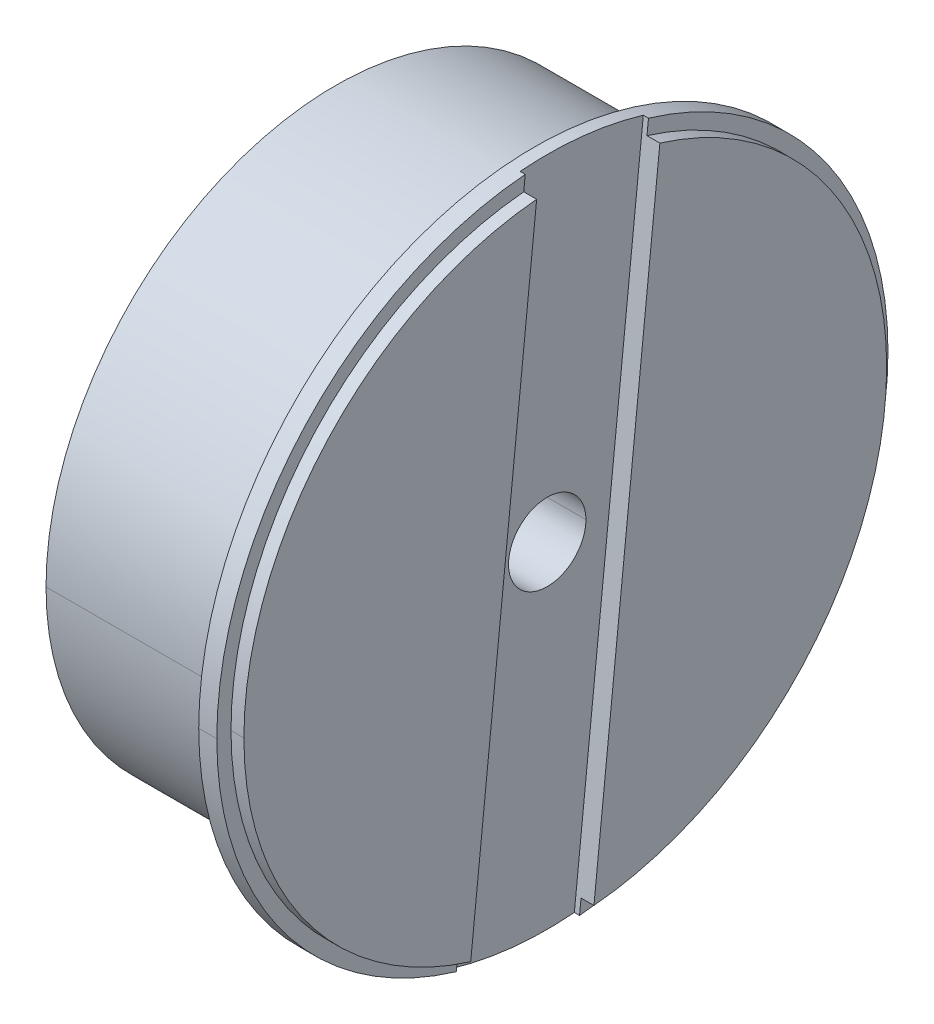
ISO-10303-21;
HEADER;
FILE_DESCRIPTION(('STEP AP214'),'2;1');
FILE_NAME('part.step','',(''),(''),'','','');
FILE_SCHEMA(('AUTOMOTIVE_DESIGN { 1 0 10303 214 1 1 1 1 }'));
ENDSEC;
DATA;
#1=APPLICATION_CONTEXT('core data for automotive mechanical design processes');
#2=APPLICATION_PROTOCOL_DEFINITION('international standard','automotive_design',2000,#1);
#3=PRODUCT_CONTEXT('',#1,'mechanical');
#4=PRODUCT('Part','Part','',(#3));
#5=PRODUCT_RELATED_PRODUCT_CATEGORY('part','',(#4));
#6=PRODUCT_DEFINITION_FORMATION('','',#4);
#7=PRODUCT_DEFINITION_CONTEXT('part definition',#1,'design');
#8=PRODUCT_DEFINITION('design','',#6,#7);
#9=PRODUCT_DEFINITION_SHAPE('','',#8);
#10=(LENGTH_UNIT() NAMED_UNIT(*) SI_UNIT(.MILLI.,.METRE.));
#11=(NAMED_UNIT(*) PLANE_ANGLE_UNIT() SI_UNIT($,.RADIAN.));
#12=(NAMED_UNIT(*) SI_UNIT($,.STERADIAN.) SOLID_ANGLE_UNIT());
#13=UNCERTAINTY_MEASURE_WITH_UNIT(LENGTH_MEASURE(1.E-05),#10,'distance_accuracy_value','');
#14=(GEOMETRIC_REPRESENTATION_CONTEXT(3) GLOBAL_UNCERTAINTY_ASSIGNED_CONTEXT((#13)) GLOBAL_UNIT_ASSIGNED_CONTEXT((#10,
#11,#12)) REPRESENTATION_CONTEXT('',''));
#15=CARTESIAN_POINT('',(0.,0.,0.));
#16=DIRECTION('',(0.,0.,1.));
#17=DIRECTION('',(1.,0.,0.));
#18=AXIS2_PLACEMENT_3D('',#15,#16,#17);
#19=CARTESIAN_POINT('',(68.8,0.,0.));
#20=DIRECTION('',(-1.,0.,0.));
#21=DIRECTION('',(0.,0.,-1.));
#22=AXIS2_PLACEMENT_3D('',#19,#20,#21);
#23=CYLINDRICAL_SURFACE('',#22,11.215);
#24=DIRECTION('',(-1.,0.,0.));
#25=VECTOR('',#24,1.);
#26=CARTESIAN_POINT('',(68.8,0.,-11.215));
#27=LINE('',#26,#25);
#28=CARTESIAN_POINT('',(72.3,0.,-11.215));
#29=VERTEX_POINT('',#28);
#30=CARTESIAN_POINT('',(64.6,0.,-11.215));
#31=VERTEX_POINT('',#30);
#32=EDGE_CURVE('E191',#29,#31,#27,.T.);
#33=ORIENTED_EDGE('',*,*,#32,.F.);
#34=CARTESIAN_POINT('',(72.3,0.,0.));
#35=DIRECTION('',(1.,0.,0.));
#36=DIRECTION('',(0.,0.,-1.));
#37=AXIS2_PLACEMENT_3D('',#34,#35,#36);
#38=CIRCLE('',#37,11.215);
#39=CARTESIAN_POINT('',(72.3,0.,11.215));
#40=VERTEX_POINT('',#39);
#41=EDGE_CURVE('E40',#40,#29,#38,.T.);
#42=ORIENTED_EDGE('',*,*,#41,.F.);
#43=DIRECTION('',(1.,0.,0.));
#44=VECTOR('',#43,1.);
#45=CARTESIAN_POINT('',(68.8,0.,11.215));
#46=LINE('',#45,#44);
#47=CARTESIAN_POINT('',(64.6,0.,11.215));
#48=VERTEX_POINT('',#47);
#49=EDGE_CURVE('E188',#48,#40,#46,.T.);
#50=ORIENTED_EDGE('',*,*,#49,.F.);
#51=CARTESIAN_POINT('',(64.6,0.,0.));
#52=DIRECTION('',(-1.,0.,0.));
#53=DIRECTION('',(0.,0.,-1.));
#54=AXIS2_PLACEMENT_3D('',#51,#52,#53);
#55=CIRCLE('',#54,11.215);
#56=EDGE_CURVE('E192',#31,#48,#55,.T.);
#57=ORIENTED_EDGE('',*,*,#56,.F.);
#58=EDGE_LOOP('',(#33,#42,#50,#57));
#59=FACE_BOUND('',#58,.T.);
#60=ADVANCED_FACE('F16',(#59),#23,.T.);
#61=CARTESIAN_POINT('',(73.25,0.,0.));
#62=DIRECTION('',(1.,0.,0.));
#63=DIRECTION('',(0.,0.,-1.));
#64=AXIS2_PLACEMENT_3D('',#61,#62,#63);
#65=CYLINDRICAL_SURFACE('',#64,12.45);
#66=DIRECTION('',(1.,0.,0.));
#67=VECTOR('',#66,1.);
#68=CARTESIAN_POINT('',(73.25,0.,-12.45));
#69=LINE('',#68,#67);
#70=CARTESIAN_POINT('',(73.,0.,-12.45));
#71=VERTEX_POINT('',#70);
#72=CARTESIAN_POINT('',(73.5,0.,-12.45));
#73=VERTEX_POINT('',#72);
#74=EDGE_CURVE('E247',#71,#73,#69,.T.);
#75=ORIENTED_EDGE('',*,*,#74,.F.);
#76=CARTESIAN_POINT('',(73.,0.,0.));
#77=DIRECTION('',(-1.,0.,0.));
#78=DIRECTION('',(0.,0.,-1.));
#79=AXIS2_PLACEMENT_3D('',#76,#77,#78);
#80=CIRCLE('',#79,12.45);
#81=CARTESIAN_POINT('',(73.,11.8986932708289,-3.66382292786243));
#82=VERTEX_POINT('',#81);
#83=EDGE_CURVE('E187',#82,#71,#80,.T.);
#84=ORIENTED_EDGE('',*,*,#83,.F.);
#85=DIRECTION('',(1.,0.,0.));
#86=VECTOR('',#85,1.);
#87=CARTESIAN_POINT('',(73.25,11.8986932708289,-3.66382292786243));
#88=LINE('',#87,#86);
#89=CARTESIAN_POINT('',(73.5,11.8986932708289,-3.66382292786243));
#90=VERTEX_POINT('',#89);
#91=EDGE_CURVE('E11',#82,#90,#88,.T.);
#92=ORIENTED_EDGE('',*,*,#91,.T.);
#93=CARTESIAN_POINT('',(73.5,0.,0.));
#94=DIRECTION('',(1.,0.,0.));
#95=DIRECTION('',(0.,0.,-1.));
#96=AXIS2_PLACEMENT_3D('',#93,#94,#95);
#97=CIRCLE('',#96,12.45);
#98=EDGE_CURVE('E240',#73,#90,#97,.T.);
#99=ORIENTED_EDGE('',*,*,#98,.F.);
#100=EDGE_LOOP('',(#75,#84,#92,#99));
#101=FACE_BOUND('',#100,.T.);
#102=ADVANCED_FACE('F564',(#101),#65,.T.);
#103=CARTESIAN_POINT('',(72.65,0.,0.));
#104=DIRECTION('',(-1.,0.,0.));
#105=DIRECTION('',(0.,0.,-1.));
#106=AXIS2_PLACEMENT_3D('',#103,#104,#105);
#107=CYLINDRICAL_SURFACE('',#106,13.);
#108=DIRECTION('',(-1.,0.,0.));
#109=VECTOR('',#108,1.);
#110=CARTESIAN_POINT('',(72.65,0.,-13.));
#111=LINE('',#110,#109);
#112=CARTESIAN_POINT('',(73.,0.,-13.));
#113=VERTEX_POINT('',#112);
#114=CARTESIAN_POINT('',(72.3,0.,-13.));
#115=VERTEX_POINT('',#114);
#116=EDGE_CURVE('E150',#113,#115,#111,.T.);
#117=ORIENTED_EDGE('',*,*,#116,.F.);
#118=CARTESIAN_POINT('',(73.,0.,0.));
#119=DIRECTION('',(1.,0.,0.));
#120=DIRECTION('',(0.,0.,-1.));
#121=AXIS2_PLACEMENT_3D('',#118,#119,#120);
#122=CIRCLE('',#121,13.);
#123=CARTESIAN_POINT('',(73.,-12.9574180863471,-1.05134035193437));
#124=VERTEX_POINT('',#123);
#125=EDGE_CURVE('E144',#124,#113,#122,.T.);
#126=ORIENTED_EDGE('',*,*,#125,.F.);
#127=DIRECTION('',(-1.,0.,0.));
#128=VECTOR('',#127,1.);
#129=CARTESIAN_POINT('',(72.9,-12.9574180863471,-1.05134035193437));
#130=LINE('',#129,#128);
#131=CARTESIAN_POINT('',(72.8,-12.9574180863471,-1.05134035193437));
#132=VERTEX_POINT('',#131);
#133=EDGE_CURVE('E27',#124,#132,#130,.T.);
#134=ORIENTED_EDGE('',*,*,#133,.T.);
#135=CARTESIAN_POINT('',(72.8,0.,0.));
#136=DIRECTION('',(-1.,0.,0.));
#137=DIRECTION('',(0.,0.,-1.));
#138=AXIS2_PLACEMENT_3D('',#135,#136,#137);
#139=CIRCLE('',#138,13.);
#140=CARTESIAN_POINT('',(72.8,-12.4556814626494,3.72236474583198));
#141=VERTEX_POINT('',#140);
#142=EDGE_CURVE('E166',#132,#141,#139,.T.);
#143=ORIENTED_EDGE('',*,*,#142,.T.);
#144=DIRECTION('',(1.,0.,0.));
#145=VECTOR('',#144,1.);
#146=CARTESIAN_POINT('',(72.9,-12.4556814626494,3.72236474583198));
#147=LINE('',#146,#145);
#148=CARTESIAN_POINT('',(73.,-12.4556814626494,3.72236474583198));
#149=VERTEX_POINT('',#148);
#150=EDGE_CURVE('E288',#141,#149,#147,.T.);
#151=ORIENTED_EDGE('',*,*,#150,.T.);
#152=CARTESIAN_POINT('',(73.,0.,0.));
#153=DIRECTION('',(1.,0.,0.));
#154=DIRECTION('',(0.,0.,-1.));
#155=AXIS2_PLACEMENT_3D('',#152,#153,#154);
#156=CIRCLE('',#155,13.);
#157=CARTESIAN_POINT('',(73.,0.,13.));
#158=VERTEX_POINT('',#157);
#159=EDGE_CURVE('E174',#158,#149,#156,.T.);
#160=ORIENTED_EDGE('',*,*,#159,.F.);
#161=DIRECTION('',(1.,0.,0.));
#162=VECTOR('',#161,1.);
#163=CARTESIAN_POINT('',(72.65,0.,13.));
#164=LINE('',#163,#162);
#165=CARTESIAN_POINT('',(72.3,0.,13.));
#166=VERTEX_POINT('',#165);
#167=EDGE_CURVE('E217',#166,#158,#164,.T.);
#168=ORIENTED_EDGE('',*,*,#167,.F.);
#169=CARTESIAN_POINT('',(72.3,0.,0.));
#170=DIRECTION('',(-1.,0.,0.));
#171=DIRECTION('',(0.,0.,-1.));
#172=AXIS2_PLACEMENT_3D('',#169,#170,#171);
#173=CIRCLE('',#172,13.);
#174=EDGE_CURVE('E261',#115,#166,#173,.T.);
#175=ORIENTED_EDGE('',*,*,#174,.F.);
#176=EDGE_LOOP('',(#117,#126,#134,#143,#151,#160,#168,#175));
#177=FACE_BOUND('',#176,.T.);
#178=ADVANCED_FACE('F146',(#177),#107,.T.);
#179=CARTESIAN_POINT('',(73.25,0.,0.));
#180=DIRECTION('',(1.,0.,0.));
#181=DIRECTION('',(0.,0.,-1.));
#182=AXIS2_PLACEMENT_3D('',#179,#180,#181);
#183=CYLINDRICAL_SURFACE('',#182,12.45);
#184=DIRECTION('',(-1.,0.,0.));
#185=VECTOR('',#184,1.);
#186=CARTESIAN_POINT('',(73.25,0.,12.45));
#187=LINE('',#186,#185);
#188=CARTESIAN_POINT('',(73.5,0.,12.45));
#189=VERTEX_POINT('',#188);
#190=CARTESIAN_POINT('',(73.,0.,12.45));
#191=VERTEX_POINT('',#190);
#192=EDGE_CURVE('E225',#189,#191,#187,.T.);
#193=ORIENTED_EDGE('',*,*,#192,.F.);
#194=CARTESIAN_POINT('',(73.5,0.,0.));
#195=DIRECTION('',(1.,0.,0.));
#196=DIRECTION('',(0.,0.,-1.));
#197=AXIS2_PLACEMENT_3D('',#194,#195,#196);
#198=CIRCLE('',#197,12.45);
#199=CARTESIAN_POINT('',(73.5,12.4004298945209,1.10988216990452));
#200=VERTEX_POINT('',#199);
#201=EDGE_CURVE('E278',#200,#189,#198,.T.);
#202=ORIENTED_EDGE('',*,*,#201,.F.);
#203=DIRECTION('',(-1.,0.,0.));
#204=VECTOR('',#203,1.);
#205=CARTESIAN_POINT('',(73.25,12.4004298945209,1.10988216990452));
#206=LINE('',#205,#204);
#207=CARTESIAN_POINT('',(73.,12.4004298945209,1.10988216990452));
#208=VERTEX_POINT('',#207);
#209=EDGE_CURVE('E284',#200,#208,#206,.T.);
#210=ORIENTED_EDGE('',*,*,#209,.T.);
#211=CARTESIAN_POINT('',(73.,0.,0.));
#212=DIRECTION('',(-1.,0.,0.));
#213=DIRECTION('',(0.,0.,-1.));
#214=AXIS2_PLACEMENT_3D('',#211,#212,#213);
#215=CIRCLE('',#214,12.45);
#216=EDGE_CURVE('E235',#191,#208,#215,.T.);
#217=ORIENTED_EDGE('',*,*,#216,.F.);
#218=EDGE_LOOP('',(#193,#202,#210,#217));
#219=FACE_BOUND('',#218,.T.);
#220=ADVANCED_FACE('F563',(#219),#183,.T.);
#221=CARTESIAN_POINT('',(65.,0.,0.));
#222=DIRECTION('',(-1.,0.,0.));
#223=DIRECTION('',(0.,0.,-1.));
#224=AXIS2_PLACEMENT_3D('',#221,#222,#223);
#225=CYLINDRICAL_SURFACE('',#224,1.5);
#226=DIRECTION('',(1.,0.,0.));
#227=VECTOR('',#226,1.);
#228=CARTESIAN_POINT('',(65.,0.,-1.5));
#229=LINE('',#228,#227);
#230=CARTESIAN_POINT('',(64.6,0.,-1.5));
#231=VERTEX_POINT('',#230);
#232=CARTESIAN_POINT('',(72.8,0.,-1.5));
#233=VERTEX_POINT('',#232);
#234=EDGE_CURVE('E255',#231,#233,#229,.T.);
#235=ORIENTED_EDGE('',*,*,#234,.F.);
#236=CARTESIAN_POINT('',(64.6,0.,0.));
#237=DIRECTION('',(1.,0.,0.));
#238=DIRECTION('',(0.,0.,-1.));
#239=AXIS2_PLACEMENT_3D('',#236,#237,#238);
#240=CIRCLE('',#239,1.5);
#241=CARTESIAN_POINT('',(64.6,0.,1.5));
#242=VERTEX_POINT('',#241);
#243=EDGE_CURVE('E211',#242,#231,#240,.T.);
#244=ORIENTED_EDGE('',*,*,#243,.F.);
#245=DIRECTION('',(-1.,0.,0.));
#246=VECTOR('',#245,1.);
#247=CARTESIAN_POINT('',(65.,0.,1.5));
#248=LINE('',#247,#246);
#249=CARTESIAN_POINT('',(72.8,0.,1.5));
#250=VERTEX_POINT('',#249);
#251=EDGE_CURVE('E251',#250,#242,#248,.T.);
#252=ORIENTED_EDGE('',*,*,#251,.F.);
#253=CARTESIAN_POINT('',(72.8,0.,0.));
#254=DIRECTION('',(-1.,0.,0.));
#255=DIRECTION('',(0.,0.,-1.));
#256=AXIS2_PLACEMENT_3D('',#253,#254,#255);
#257=CIRCLE('',#256,1.5);
#258=EDGE_CURVE('E274',#233,#250,#257,.T.);
#259=ORIENTED_EDGE('',*,*,#258,.F.);
#260=EDGE_LOOP('',(#235,#244,#252,#259));
#261=FACE_BOUND('',#260,.T.);
#262=ADVANCED_FACE('F590',(#261),#225,.F.);
#263=CARTESIAN_POINT('',(65.,0.,0.));
#264=DIRECTION('',(-1.,0.,0.));
#265=DIRECTION('',(0.,0.,-1.));
#266=AXIS2_PLACEMENT_3D('',#263,#264,#265);
#267=CYLINDRICAL_SURFACE('',#266,1.5);
#268=ORIENTED_EDGE('',*,*,#234,.T.);
#269=CARTESIAN_POINT('',(72.8,0.,0.));
#270=DIRECTION('',(-1.,0.,0.));
#271=DIRECTION('',(0.,0.,-1.));
#272=AXIS2_PLACEMENT_3D('',#269,#270,#271);
#273=CIRCLE('',#272,1.5);
#274=EDGE_CURVE('E311',#250,#233,#273,.T.);
#275=ORIENTED_EDGE('',*,*,#274,.F.);
#276=ORIENTED_EDGE('',*,*,#251,.T.);
#277=CARTESIAN_POINT('',(64.6,0.,0.));
#278=DIRECTION('',(1.,0.,0.));
#279=DIRECTION('',(0.,0.,-1.));
#280=AXIS2_PLACEMENT_3D('',#277,#278,#279);
#281=CIRCLE('',#280,1.5);
#282=EDGE_CURVE('E281',#231,#242,#281,.T.);
#283=ORIENTED_EDGE('',*,*,#282,.F.);
#284=EDGE_LOOP('',(#268,#275,#276,#283));
#285=FACE_BOUND('',#284,.T.);
#286=ADVANCED_FACE('F581',(#285),#267,.F.);
#287=CARTESIAN_POINT('',(73.5,0.,0.));
#288=DIRECTION('',(1.,0.,0.));
#289=DIRECTION('',(0.,1.,0.));
#290=AXIS2_PLACEMENT_3D('',#287,#288,#289);
#291=PLANE('',#290);
#292=DIRECTION('',(0.,0.994521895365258,-0.104528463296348));
#293=VECTOR('',#292,1.);
#294=CARTESIAN_POINT('',(73.5,-2.98132784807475,2.72657005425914));
#295=LINE('',#294,#293);
#296=CARTESIAN_POINT('',(73.5,-11.8986932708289,3.66382292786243));
#297=VERTEX_POINT('',#296);
#298=EDGE_CURVE('E256',#297,#200,#295,.T.);
#299=ORIENTED_EDGE('',*,*,#298,.T.);
#300=ORIENTED_EDGE('',*,*,#201,.T.);
#301=CARTESIAN_POINT('',(73.5,0.,0.));
#302=DIRECTION('',(1.,0.,0.));
#303=DIRECTION('',(0.,0.,-1.));
#304=AXIS2_PLACEMENT_3D('',#301,#302,#303);
#305=CIRCLE('',#304,12.45);
#306=EDGE_CURVE('E275',#189,#297,#305,.T.);
#307=ORIENTED_EDGE('',*,*,#306,.T.);
#308=EDGE_LOOP('',(#299,#300,#307));
#309=FACE_BOUND('',#308,.T.);
#310=ADVANCED_FACE('F337',(#309),#291,.T.);
#311=CARTESIAN_POINT('',(73.5,0.,0.));
#312=DIRECTION('',(1.,0.,0.));
#313=DIRECTION('',(0.,1.,0.));
#314=AXIS2_PLACEMENT_3D('',#311,#312,#313);
#315=PLANE('',#314);
#316=DIRECTION('',(0.,-0.994521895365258,0.104528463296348));
#317=VECTOR('',#316,1.);
#318=CARTESIAN_POINT('',(73.5,-3.48306447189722,-2.0471350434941));
#319=LINE('',#318,#317);
#320=CARTESIAN_POINT('',(73.5,-12.4004298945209,-1.10988216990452));
#321=VERTEX_POINT('',#320);
#322=EDGE_CURVE('E214',#90,#321,#319,.T.);
#323=ORIENTED_EDGE('',*,*,#322,.T.);
#324=CARTESIAN_POINT('',(73.5,0.,0.));
#325=DIRECTION('',(1.,0.,0.));
#326=DIRECTION('',(0.,0.,-1.));
#327=AXIS2_PLACEMENT_3D('',#324,#325,#326);
#328=CIRCLE('',#327,12.45);
#329=EDGE_CURVE('E236',#321,#73,#328,.T.);
#330=ORIENTED_EDGE('',*,*,#329,.T.);
#331=ORIENTED_EDGE('',*,*,#98,.T.);
#332=EDGE_LOOP('',(#323,#330,#331));
#333=FACE_BOUND('',#332,.T.);
#334=ADVANCED_FACE('F383',(#333),#315,.T.);
#335=CARTESIAN_POINT('',(73.25,0.,0.));
#336=DIRECTION('',(1.,0.,0.));
#337=DIRECTION('',(0.,0.,-1.));
#338=AXIS2_PLACEMENT_3D('',#335,#336,#337);
#339=CYLINDRICAL_SURFACE('',#338,12.45);
#340=ORIENTED_EDGE('',*,*,#192,.T.);
#341=CARTESIAN_POINT('',(73.,0.,0.));
#342=DIRECTION('',(-1.,0.,0.));
#343=DIRECTION('',(0.,0.,-1.));
#344=AXIS2_PLACEMENT_3D('',#341,#342,#343);
#345=CIRCLE('',#344,12.45);
#346=CARTESIAN_POINT('',(73.,-11.8986932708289,3.66382292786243));
#347=VERTEX_POINT('',#346);
#348=EDGE_CURVE('E262',#347,#191,#345,.T.);
#349=ORIENTED_EDGE('',*,*,#348,.F.);
#350=DIRECTION('',(1.,0.,0.));
#351=VECTOR('',#350,1.);
#352=CARTESIAN_POINT('',(73.25,-11.8986932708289,3.66382292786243));
#353=LINE('',#352,#351);
#354=EDGE_CURVE('E222',#347,#297,#353,.T.);
#355=ORIENTED_EDGE('',*,*,#354,.T.);
#356=ORIENTED_EDGE('',*,*,#306,.F.);
#357=EDGE_LOOP('',(#340,#349,#355,#356));
#358=FACE_BOUND('',#357,.T.);
#359=ADVANCED_FACE('F344',(#358),#339,.T.);
#360=CARTESIAN_POINT('',(72.65,0.,0.));
#361=DIRECTION('',(-1.,0.,0.));
#362=DIRECTION('',(0.,0.,-1.));
#363=AXIS2_PLACEMENT_3D('',#360,#361,#362);
#364=CYLINDRICAL_SURFACE('',#363,13.);
#365=ORIENTED_EDGE('',*,*,#116,.T.);
#366=CARTESIAN_POINT('',(72.3,0.,0.));
#367=DIRECTION('',(-1.,0.,0.));
#368=DIRECTION('',(0.,0.,-1.));
#369=AXIS2_PLACEMENT_3D('',#366,#367,#368);
#370=CIRCLE('',#369,13.);
#371=EDGE_CURVE('E257',#166,#115,#370,.T.);
#372=ORIENTED_EDGE('',*,*,#371,.F.);
#373=ORIENTED_EDGE('',*,*,#167,.T.);
#374=CARTESIAN_POINT('',(73.,0.,0.));
#375=DIRECTION('',(1.,0.,0.));
#376=DIRECTION('',(0.,0.,-1.));
#377=AXIS2_PLACEMENT_3D('',#374,#375,#376);
#378=CIRCLE('',#377,13.);
#379=CARTESIAN_POINT('',(73.,12.9574180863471,1.05134035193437));
#380=VERTEX_POINT('',#379);
#381=EDGE_CURVE('E181',#380,#158,#378,.T.);
#382=ORIENTED_EDGE('',*,*,#381,.F.);
#383=DIRECTION('',(-1.,0.,0.));
#384=VECTOR('',#383,1.);
#385=CARTESIAN_POINT('',(72.9,12.9574180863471,1.05134035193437));
#386=LINE('',#385,#384);
#387=CARTESIAN_POINT('',(72.8,12.9574180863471,1.05134035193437));
#388=VERTEX_POINT('',#387);
#389=EDGE_CURVE('E221',#380,#388,#386,.T.);
#390=ORIENTED_EDGE('',*,*,#389,.T.);
#391=CARTESIAN_POINT('',(72.8,0.,0.));
#392=DIRECTION('',(-1.,0.,0.));
#393=DIRECTION('',(0.,0.,-1.));
#394=AXIS2_PLACEMENT_3D('',#391,#392,#393);
#395=CIRCLE('',#394,13.);
#396=CARTESIAN_POINT('',(72.8,12.4556814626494,-3.72236474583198));
#397=VERTEX_POINT('',#396);
#398=EDGE_CURVE('E230',#388,#397,#395,.T.);
#399=ORIENTED_EDGE('',*,*,#398,.T.);
#400=DIRECTION('',(1.,0.,0.));
#401=VECTOR('',#400,1.);
#402=CARTESIAN_POINT('',(72.9,12.4556814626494,-3.72236474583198));
#403=LINE('',#402,#401);
#404=CARTESIAN_POINT('',(73.,12.4556814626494,-3.72236474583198));
#405=VERTEX_POINT('',#404);
#406=EDGE_CURVE('E269',#397,#405,#403,.T.);
#407=ORIENTED_EDGE('',*,*,#406,.T.);
#408=CARTESIAN_POINT('',(73.,0.,0.));
#409=DIRECTION('',(1.,0.,0.));
#410=DIRECTION('',(0.,0.,-1.));
#411=AXIS2_PLACEMENT_3D('',#408,#409,#410);
#412=CIRCLE('',#411,13.);
#413=EDGE_CURVE('E156',#113,#405,#412,.T.);
#414=ORIENTED_EDGE('',*,*,#413,.F.);
#415=EDGE_LOOP('',(#365,#372,#373,#382,#390,#399,#407,#414));
#416=FACE_BOUND('',#415,.T.);
#417=ADVANCED_FACE('F645',(#416),#364,.T.);
#418=CARTESIAN_POINT('',(73.,0.,0.));
#419=DIRECTION('',(1.,0.,0.));
#420=DIRECTION('',(0.,1.,0.));
#421=AXIS2_PLACEMENT_3D('',#418,#419,#420);
#422=PLANE('',#421);
#423=DIRECTION('',(0.,0.994521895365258,-0.104528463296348));
#424=VECTOR('',#423,1.);
#425=CARTESIAN_POINT('',(73.,-2.98132784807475,2.72657005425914));
#426=LINE('',#425,#424);
#427=EDGE_CURVE('E266',#149,#347,#426,.T.);
#428=ORIENTED_EDGE('',*,*,#427,.T.);
#429=ORIENTED_EDGE('',*,*,#348,.T.);
#430=ORIENTED_EDGE('',*,*,#216,.T.);
#431=DIRECTION('',(0.,0.994521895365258,-0.104528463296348));
#432=VECTOR('',#431,1.);
#433=CARTESIAN_POINT('',(73.,3.48306447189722,2.0471350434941));
#434=LINE('',#433,#432);
#435=EDGE_CURVE('E231',#208,#380,#434,.T.);
#436=ORIENTED_EDGE('',*,*,#435,.T.);
#437=ORIENTED_EDGE('',*,*,#381,.T.);
#438=ORIENTED_EDGE('',*,*,#159,.T.);
#439=EDGE_LOOP('',(#428,#429,#430,#436,#437,#438));
#440=FACE_BOUND('',#439,.T.);
#441=ADVANCED_FACE('F18',(#440),#422,.T.);
#442=CARTESIAN_POINT('',(73.,0.,0.));
#443=DIRECTION('',(1.,0.,0.));
#444=DIRECTION('',(0.,1.,0.));
#445=AXIS2_PLACEMENT_3D('',#442,#443,#444);
#446=PLANE('',#445);
#447=DIRECTION('',(0.,-0.994521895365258,0.104528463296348));
#448=VECTOR('',#447,1.);
#449=CARTESIAN_POINT('',(73.,-3.48306447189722,-2.0471350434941));
#450=LINE('',#449,#448);
#451=CARTESIAN_POINT('',(73.,-12.4004298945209,-1.10988216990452));
#452=VERTEX_POINT('',#451);
#453=EDGE_CURVE('E155',#452,#124,#450,.T.);
#454=ORIENTED_EDGE('',*,*,#453,.T.);
#455=ORIENTED_EDGE('',*,*,#125,.T.);
#456=ORIENTED_EDGE('',*,*,#413,.T.);
#457=DIRECTION('',(0.,-0.994521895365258,0.104528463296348));
#458=VECTOR('',#457,1.);
#459=CARTESIAN_POINT('',(73.,2.98132784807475,-2.72657005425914));
#460=LINE('',#459,#458);
#461=EDGE_CURVE('E241',#405,#82,#460,.T.);
#462=ORIENTED_EDGE('',*,*,#461,.T.);
#463=ORIENTED_EDGE('',*,*,#83,.T.);
#464=CARTESIAN_POINT('',(73.,0.,0.));
#465=DIRECTION('',(-1.,0.,0.));
#466=DIRECTION('',(0.,0.,-1.));
#467=AXIS2_PLACEMENT_3D('',#464,#465,#466);
#468=CIRCLE('',#467,12.45);
#469=EDGE_CURVE('E172',#71,#452,#468,.T.);
#470=ORIENTED_EDGE('',*,*,#469,.T.);
#471=EDGE_LOOP('',(#454,#455,#456,#462,#463,#470));
#472=FACE_BOUND('',#471,.T.);
#473=ADVANCED_FACE('F169',(#472),#446,.T.);
#474=CARTESIAN_POINT('',(73.15,6.21352400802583,-3.06628755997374));
#475=DIRECTION('',(0.,0.104528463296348,0.994521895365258));
#476=DIRECTION('',(1.,0.,0.));
#477=AXIS2_PLACEMENT_3D('',#474,#475,#476);
#478=PLANE('',#477);
#479=ORIENTED_EDGE('',*,*,#406,.F.);
#480=DIRECTION('',(0.,-0.994521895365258,0.104528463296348));
#481=VECTOR('',#480,1.);
#482=CARTESIAN_POINT('',(72.8,-6.7152606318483,-1.7074175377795));
#483=LINE('',#482,#481);
#484=EDGE_CURVE('E164',#397,#132,#483,.T.);
#485=ORIENTED_EDGE('',*,*,#484,.T.);
#486=ORIENTED_EDGE('',*,*,#133,.F.);
#487=ORIENTED_EDGE('',*,*,#453,.F.);
#488=DIRECTION('',(-1.,0.,0.));
#489=VECTOR('',#488,1.);
#490=CARTESIAN_POINT('',(73.25,-12.4004298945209,-1.10988216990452));
#491=LINE('',#490,#489);
#492=EDGE_CURVE('E202',#321,#452,#491,.T.);
#493=ORIENTED_EDGE('',*,*,#492,.F.);
#494=ORIENTED_EDGE('',*,*,#322,.F.);
#495=ORIENTED_EDGE('',*,*,#91,.F.);
#496=ORIENTED_EDGE('',*,*,#461,.F.);
#497=EDGE_LOOP('',(#479,#485,#486,#487,#493,#494,#495,#496));
#498=FACE_BOUND('',#497,.T.);
#499=ADVANCED_FACE('F160',(#498),#478,.T.);
#500=CARTESIAN_POINT('',(72.8,6.46439231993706,-0.679435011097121));
#501=DIRECTION('',(1.,0.,0.));
#502=DIRECTION('',(0.,1.,0.));
#503=AXIS2_PLACEMENT_3D('',#500,#501,#502);
#504=PLANE('',#503);
#505=ORIENTED_EDGE('',*,*,#398,.F.);
#506=DIRECTION('',(0.,-0.994521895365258,0.104528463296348));
#507=VECTOR('',#506,1.);
#508=CARTESIAN_POINT('',(72.8,-6.21352400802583,3.06628755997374));
#509=LINE('',#508,#507);
#510=EDGE_CURVE('E20',#388,#141,#509,.T.);
#511=ORIENTED_EDGE('',*,*,#510,.T.);
#512=ORIENTED_EDGE('',*,*,#142,.F.);
#513=ORIENTED_EDGE('',*,*,#484,.F.);
#514=EDGE_LOOP('',(#505,#511,#512,#513));
#515=FACE_BOUND('',#514,.T.);
#516=ORIENTED_EDGE('',*,*,#274,.T.);
#517=ORIENTED_EDGE('',*,*,#258,.T.);
#518=EDGE_LOOP('',(#516,#517));
#519=FACE_BOUND('',#518,.T.);
#520=ADVANCED_FACE('F526',(#515,#519),#504,.T.);
#521=CARTESIAN_POINT('',(73.15,6.7152606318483,1.7074175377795));
#522=DIRECTION('',(0.,-0.104528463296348,-0.994521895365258));
#523=DIRECTION('',(0.,-0.994521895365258,0.104528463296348));
#524=AXIS2_PLACEMENT_3D('',#521,#522,#523);
#525=PLANE('',#524);
#526=ORIENTED_EDGE('',*,*,#389,.F.);
#527=ORIENTED_EDGE('',*,*,#435,.F.);
#528=ORIENTED_EDGE('',*,*,#209,.F.);
#529=ORIENTED_EDGE('',*,*,#298,.F.);
#530=ORIENTED_EDGE('',*,*,#354,.F.);
#531=ORIENTED_EDGE('',*,*,#427,.F.);
#532=ORIENTED_EDGE('',*,*,#150,.F.);
#533=ORIENTED_EDGE('',*,*,#510,.F.);
#534=EDGE_LOOP('',(#526,#527,#528,#529,#530,#531,#532,#533));
#535=FACE_BOUND('',#534,.T.);
#536=ADVANCED_FACE('F349',(#535),#525,.T.);
#537=CARTESIAN_POINT('',(73.25,0.,0.));
#538=DIRECTION('',(1.,0.,0.));
#539=DIRECTION('',(0.,0.,-1.));
#540=AXIS2_PLACEMENT_3D('',#537,#538,#539);
#541=CYLINDRICAL_SURFACE('',#540,12.45);
#542=ORIENTED_EDGE('',*,*,#74,.T.);
#543=ORIENTED_EDGE('',*,*,#329,.F.);
#544=ORIENTED_EDGE('',*,*,#492,.T.);
#545=ORIENTED_EDGE('',*,*,#469,.F.);
#546=EDGE_LOOP('',(#542,#543,#544,#545));
#547=FACE_BOUND('',#546,.T.);
#548=ADVANCED_FACE('F378',(#547),#541,.T.);
#549=CARTESIAN_POINT('',(68.8,0.,0.));
#550=DIRECTION('',(-1.,0.,0.));
#551=DIRECTION('',(0.,0.,-1.));
#552=AXIS2_PLACEMENT_3D('',#549,#550,#551);
#553=CYLINDRICAL_SURFACE('',#552,11.215);
#554=ORIENTED_EDGE('',*,*,#32,.T.);
#555=CARTESIAN_POINT('',(64.6,0.,0.));
#556=DIRECTION('',(-1.,0.,0.));
#557=DIRECTION('',(0.,0.,-1.));
#558=AXIS2_PLACEMENT_3D('',#555,#556,#557);
#559=CIRCLE('',#558,11.215);
#560=EDGE_CURVE('E204',#48,#31,#559,.T.);
#561=ORIENTED_EDGE('',*,*,#560,.F.);
#562=ORIENTED_EDGE('',*,*,#49,.T.);
#563=CARTESIAN_POINT('',(72.3,0.,0.));
#564=DIRECTION('',(1.,0.,0.));
#565=DIRECTION('',(0.,0.,-1.));
#566=AXIS2_PLACEMENT_3D('',#563,#564,#565);
#567=CIRCLE('',#566,11.215);
#568=EDGE_CURVE('E248',#29,#40,#567,.T.);
#569=ORIENTED_EDGE('',*,*,#568,.F.);
#570=EDGE_LOOP('',(#554,#561,#562,#569));
#571=FACE_BOUND('',#570,.T.);
#572=ADVANCED_FACE('F546',(#571),#553,.T.);
#573=CARTESIAN_POINT('',(64.6,0.,0.));
#574=DIRECTION('',(-1.,0.,0.));
#575=DIRECTION('',(0.,0.,1.));
#576=AXIS2_PLACEMENT_3D('',#573,#574,#575);
#577=PLANE('',#576);
#578=ORIENTED_EDGE('',*,*,#56,.T.);
#579=ORIENTED_EDGE('',*,*,#560,.T.);
#580=EDGE_LOOP('',(#578,#579));
#581=FACE_BOUND('',#580,.T.);
#582=ORIENTED_EDGE('',*,*,#243,.T.);
#583=ORIENTED_EDGE('',*,*,#282,.T.);
#584=EDGE_LOOP('',(#582,#583));
#585=FACE_BOUND('',#584,.T.);
#586=ADVANCED_FACE('F536',(#581,#585),#577,.T.);
#587=CARTESIAN_POINT('',(72.3,0.,0.));
#588=DIRECTION('',(-1.,0.,0.));
#589=DIRECTION('',(0.,0.,1.));
#590=AXIS2_PLACEMENT_3D('',#587,#588,#589);
#591=PLANE('',#590);
#592=ORIENTED_EDGE('',*,*,#174,.T.);
#593=ORIENTED_EDGE('',*,*,#371,.T.);
#594=EDGE_LOOP('',(#592,#593));
#595=FACE_BOUND('',#594,.T.);
#596=ORIENTED_EDGE('',*,*,#41,.T.);
#597=ORIENTED_EDGE('',*,*,#568,.T.);
#598=EDGE_LOOP('',(#596,#597));
#599=FACE_BOUND('',#598,.T.);
#600=ADVANCED_FACE('F532',(#595,#599),#591,.T.);
#601=CLOSED_SHELL('',(#60,#102,#178,#220,#262,#286,#310,#334,#359,#417,#441,#473,#499,#520,#536,
#548,#572,#586,#600));
#602=MANIFOLD_SOLID_BREP('B1',#601);
#603=ADVANCED_BREP_SHAPE_REPRESENTATION('',(#18,#602),#14);
#604=SHAPE_DEFINITION_REPRESENTATION(#9,#603);
ENDSEC;
END-ISO-10303-21;
